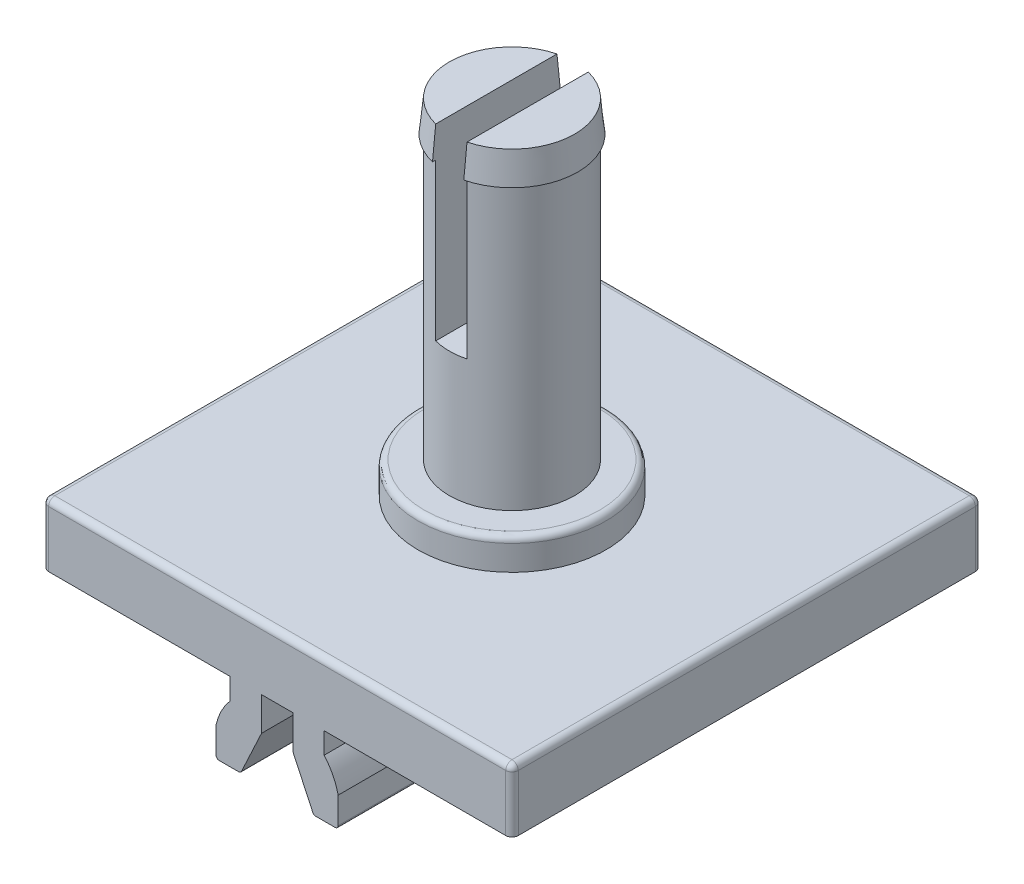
ISO-10303-21;
HEADER;
FILE_DESCRIPTION(('STEP AP214'),'2;1');
FILE_NAME('part.step','',(''),(''),'','','');
FILE_SCHEMA(('AUTOMOTIVE_DESIGN { 1 0 10303 214 1 1 1 1 }'));
ENDSEC;
DATA;
#1=APPLICATION_CONTEXT('core data for automotive mechanical design processes');
#2=APPLICATION_PROTOCOL_DEFINITION('international standard','automotive_design',2000,#1);
#3=PRODUCT_CONTEXT('',#1,'mechanical');
#4=PRODUCT('Part','Part','',(#3));
#5=PRODUCT_RELATED_PRODUCT_CATEGORY('part','',(#4));
#6=PRODUCT_DEFINITION_FORMATION('','',#4);
#7=PRODUCT_DEFINITION_CONTEXT('part definition',#1,'design');
#8=PRODUCT_DEFINITION('design','',#6,#7);
#9=PRODUCT_DEFINITION_SHAPE('','',#8);
#10=(LENGTH_UNIT() NAMED_UNIT(*) SI_UNIT(.MILLI.,.METRE.));
#11=(NAMED_UNIT(*) PLANE_ANGLE_UNIT() SI_UNIT($,.RADIAN.));
#12=(NAMED_UNIT(*) SI_UNIT($,.STERADIAN.) SOLID_ANGLE_UNIT());
#13=UNCERTAINTY_MEASURE_WITH_UNIT(LENGTH_MEASURE(1.E-05),#10,'distance_accuracy_value','');
#14=(GEOMETRIC_REPRESENTATION_CONTEXT(3) GLOBAL_UNCERTAINTY_ASSIGNED_CONTEXT((#13)) GLOBAL_UNIT_ASSIGNED_CONTEXT((#10,
#11,#12)) REPRESENTATION_CONTEXT('',''));
#15=CARTESIAN_POINT('',(0.,0.,0.));
#16=DIRECTION('',(0.,0.,1.));
#17=DIRECTION('',(1.,0.,0.));
#18=AXIS2_PLACEMENT_3D('',#15,#16,#17);
#19=CARTESIAN_POINT('',(0.,0.,0.));
#20=DIRECTION('',(0.,-1.,0.));
#21=DIRECTION('',(0.,0.,-1.));
#22=AXIS2_PLACEMENT_3D('',#19,#20,#21);
#23=PLANE('',#22);
#24=DIRECTION('',(-1.,0.,0.));
#25=VECTOR('',#24,1.);
#26=CARTESIAN_POINT('',(7.5,0.,-7.5));
#27=LINE('',#26,#25);
#28=CARTESIAN_POINT('',(7.3,0.,-7.5));
#29=VERTEX_POINT('',#28);
#30=CARTESIAN_POINT('',(1.5,0.,-7.5));
#31=VERTEX_POINT('',#30);
#32=EDGE_CURVE('E335',#29,#31,#27,.T.);
#33=ORIENTED_EDGE('',*,*,#32,.F.);
#34=CARTESIAN_POINT('',(7.3,0.,-7.3));
#35=DIRECTION('',(0.,-1.,0.));
#36=DIRECTION('',(0.,0.,-1.));
#37=AXIS2_PLACEMENT_3D('',#34,#35,#36);
#38=CIRCLE('',#37,0.2);
#39=CARTESIAN_POINT('',(7.5,0.,-7.3));
#40=VERTEX_POINT('',#39);
#41=EDGE_CURVE('E523',#29,#40,#38,.T.);
#42=ORIENTED_EDGE('',*,*,#41,.T.);
#43=DIRECTION('',(0.,0.,-1.));
#44=VECTOR('',#43,1.);
#45=CARTESIAN_POINT('',(7.5,0.,-7.5));
#46=LINE('',#45,#44);
#47=CARTESIAN_POINT('',(7.5,0.,7.3));
#48=VERTEX_POINT('',#47);
#49=EDGE_CURVE('E299',#48,#40,#46,.T.);
#50=ORIENTED_EDGE('',*,*,#49,.F.);
#51=CARTESIAN_POINT('',(7.3,0.,7.3));
#52=DIRECTION('',(0.,-1.,0.));
#53=DIRECTION('',(0.,0.,-1.));
#54=AXIS2_PLACEMENT_3D('',#51,#52,#53);
#55=CIRCLE('',#54,0.2);
#56=CARTESIAN_POINT('',(7.3,0.,7.5));
#57=VERTEX_POINT('',#56);
#58=EDGE_CURVE('E730',#48,#57,#55,.T.);
#59=ORIENTED_EDGE('',*,*,#58,.T.);
#60=DIRECTION('',(1.,0.,0.));
#61=VECTOR('',#60,1.);
#62=CARTESIAN_POINT('',(7.5,0.,7.5));
#63=LINE('',#62,#61);
#64=CARTESIAN_POINT('',(1.5,0.,7.5));
#65=VERTEX_POINT('',#64);
#66=EDGE_CURVE('E297',#65,#57,#63,.T.);
#67=ORIENTED_EDGE('',*,*,#66,.F.);
#68=DIRECTION('',(0.,0.,1.));
#69=VECTOR('',#68,1.);
#70=CARTESIAN_POINT('',(1.5,0.,-7.5));
#71=LINE('',#70,#69);
#72=EDGE_CURVE('E633',#31,#65,#71,.T.);
#73=ORIENTED_EDGE('',*,*,#72,.F.);
#74=EDGE_LOOP('',(#33,#42,#50,#59,#67,#73));
#75=FACE_BOUND('',#74,.T.);
#76=ADVANCED_FACE('F34',(#75),#23,.T.);
#77=DIRECTION('',(0.,0.,1.));
#78=VECTOR('',#77,1.);
#79=CARTESIAN_POINT('',(-7.5,0.,-7.49999999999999));
#80=LINE('',#79,#78);
#81=CARTESIAN_POINT('',(-7.5,0.,-7.29999999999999));
#82=VERTEX_POINT('',#81);
#83=CARTESIAN_POINT('',(-7.5,0.,7.30000000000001));
#84=VERTEX_POINT('',#83);
#85=EDGE_CURVE('E302',#82,#84,#80,.T.);
#86=ORIENTED_EDGE('',*,*,#85,.F.);
#87=CARTESIAN_POINT('',(-7.3,0.,-7.29999999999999));
#88=DIRECTION('',(0.,-1.,0.));
#89=DIRECTION('',(0.,0.,-1.));
#90=AXIS2_PLACEMENT_3D('',#87,#88,#89);
#91=CIRCLE('',#90,0.2);
#92=CARTESIAN_POINT('',(-7.3,0.,-7.49999999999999));
#93=VERTEX_POINT('',#92);
#94=EDGE_CURVE('E332',#82,#93,#91,.T.);
#95=ORIENTED_EDGE('',*,*,#94,.T.);
#96=CARTESIAN_POINT('',(-1.5,0.,-7.49999999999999));
#97=VERTEX_POINT('',#96);
#98=EDGE_CURVE('E307',#97,#93,#27,.T.);
#99=ORIENTED_EDGE('',*,*,#98,.F.);
#100=DIRECTION('',(0.,0.,1.));
#101=VECTOR('',#100,1.);
#102=CARTESIAN_POINT('',(-1.5,0.,-7.5));
#103=LINE('',#102,#101);
#104=CARTESIAN_POINT('',(-1.5,0.,7.50000000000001));
#105=VERTEX_POINT('',#104);
#106=EDGE_CURVE('E666',#97,#105,#103,.T.);
#107=ORIENTED_EDGE('',*,*,#106,.T.);
#108=CARTESIAN_POINT('',(-7.3,0.,7.50000000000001));
#109=VERTEX_POINT('',#108);
#110=EDGE_CURVE('E296',#109,#105,#63,.T.);
#111=ORIENTED_EDGE('',*,*,#110,.F.);
#112=CARTESIAN_POINT('',(-7.3,0.,7.30000000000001));
#113=DIRECTION('',(0.,-1.,0.));
#114=DIRECTION('',(0.,0.,-1.));
#115=AXIS2_PLACEMENT_3D('',#112,#113,#114);
#116=CIRCLE('',#115,0.2);
#117=EDGE_CURVE('E329',#109,#84,#116,.T.);
#118=ORIENTED_EDGE('',*,*,#117,.T.);
#119=EDGE_LOOP('',(#86,#95,#99,#107,#111,#118));
#120=FACE_BOUND('',#119,.T.);
#121=ADVANCED_FACE('F497',(#120),#23,.T.);
#122=CARTESIAN_POINT('',(-2.1,12.,0.));
#123=DIRECTION('',(0.,1.,0.));
#124=DIRECTION('',(0.,0.,1.));
#125=AXIS2_PLACEMENT_3D('',#122,#123,#124);
#126=PLANE('',#125);
#127=CARTESIAN_POINT('',(0.,12.,0.));
#128=DIRECTION('',(0.,-1.,0.));
#129=DIRECTION('',(0.,0.,-1.));
#130=AXIS2_PLACEMENT_3D('',#127,#128,#129);
#131=CIRCLE('',#130,2.1);
#132=CARTESIAN_POINT('',(0.499999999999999,12.,-2.03960780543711));
#133=VERTEX_POINT('',#132);
#134=CARTESIAN_POINT('',(0.5,12.,2.03960780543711));
#135=VERTEX_POINT('',#134);
#136=EDGE_CURVE('E439',#133,#135,#131,.T.);
#137=ORIENTED_EDGE('',*,*,#136,.T.);
#138=DIRECTION('',(0.,0.,-1.));
#139=VECTOR('',#138,1.);
#140=CARTESIAN_POINT('',(0.5,12.,0.));
#141=LINE('',#140,#139);
#142=CARTESIAN_POINT('',(0.5,12.,1.93649167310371));
#143=VERTEX_POINT('',#142);
#144=EDGE_CURVE('E427',#135,#143,#141,.T.);
#145=ORIENTED_EDGE('',*,*,#144,.T.);
#146=CARTESIAN_POINT('',(0.,12.,0.));
#147=DIRECTION('',(0.,1.,0.));
#148=DIRECTION('',(0.,0.,1.));
#149=AXIS2_PLACEMENT_3D('',#146,#147,#148);
#150=CIRCLE('',#149,2.);
#151=CARTESIAN_POINT('',(0.499999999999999,12.,-1.93649167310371));
#152=VERTEX_POINT('',#151);
#153=EDGE_CURVE('E346',#143,#152,#150,.T.);
#154=ORIENTED_EDGE('',*,*,#153,.T.);
#155=EDGE_CURVE('E429',#152,#133,#141,.T.);
#156=ORIENTED_EDGE('',*,*,#155,.T.);
#157=EDGE_LOOP('',(#137,#145,#154,#156));
#158=FACE_BOUND('',#157,.T.);
#159=ADVANCED_FACE('F769',(#158),#126,.F.);
#160=CARTESIAN_POINT('',(0.,13.,0.));
#161=DIRECTION('',(0.,-1.,0.));
#162=DIRECTION('',(0.,0.,-1.));
#163=AXIS2_PLACEMENT_3D('',#160,#161,#162);
#164=CONICAL_SURFACE('',#163,2.,0.0996686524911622);
#165=ORIENTED_EDGE('',*,*,#136,.F.);
#166=CARTESIAN_POINT('',(0.499999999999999,8.841130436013,-2.36357986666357));
#167=CARTESIAN_POINT('',(0.499999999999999,9.45810920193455,-2.30051294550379));
#168=CARTESIAN_POINT('',(0.499999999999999,10.075077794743,-2.23734624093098));
#169=CARTESIAN_POINT('',(0.499999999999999,11.3089863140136,-2.11073579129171));
#170=CARTESIAN_POINT('',(0.499999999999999,11.9259262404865,-2.04729204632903));
#171=CARTESIAN_POINT('',(0.499999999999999,13.1597696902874,-1.92004998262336));
#172=CARTESIAN_POINT('',(0.499999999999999,13.7766732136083,-1.85625166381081));
#173=CARTESIAN_POINT('',(0.499999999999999,15.0104289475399,-1.72815870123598));
#174=CARTESIAN_POINT('',(0.499999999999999,15.627281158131,-1.66386405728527));
#175=CARTESIAN_POINT('',(0.499999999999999,16.2441000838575,-1.59925039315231));
#176=B_SPLINE_CURVE_WITH_KNOTS('',3,(#166,#167,#168,#169,#170,#171,#172,#173,#174,#175),
.UNSPECIFIED.,.F.,.F.,(4,2,2,2,4),(0.,1.86058114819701,3.72116159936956,5.58174241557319,
7.44232393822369),.UNSPECIFIED.);
#177=CARTESIAN_POINT('',(0.499999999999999,13.,-1.93649167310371));
#178=VERTEX_POINT('',#177);
#179=EDGE_CURVE('E431',#133,#178,#176,.T.);
#180=ORIENTED_EDGE('',*,*,#179,.T.);
#181=CARTESIAN_POINT('',(0.,13.,0.));
#182=DIRECTION('',(0.,-1.,0.));
#183=DIRECTION('',(0.,0.,-1.));
#184=AXIS2_PLACEMENT_3D('',#181,#182,#183);
#185=CIRCLE('',#184,2.);
#186=CARTESIAN_POINT('',(0.5,13.,1.93649167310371));
#187=VERTEX_POINT('',#186);
#188=EDGE_CURVE('E443',#178,#187,#185,.T.);
#189=ORIENTED_EDGE('',*,*,#188,.T.);
#190=CARTESIAN_POINT('',(0.5,16.2441000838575,1.59925039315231));
#191=CARTESIAN_POINT('',(0.5,15.2336599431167,1.70508949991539));
#192=CARTESIAN_POINT('',(0.5,14.2231318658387,1.81008354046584));
#193=CARTESIAN_POINT('',(0.5,12.9893168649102,1.93760388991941));
#194=CARTESIAN_POINT('',(0.5,12.766083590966,1.96064915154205));
#195=CARTESIAN_POINT('',(0.5,11.9259262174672,2.0472929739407));
#196=CARTESIAN_POINT('',(0.5,11.3089861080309,2.11073627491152));
#197=CARTESIAN_POINT('',(0.5,10.0750774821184,2.23734581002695));
#198=CARTESIAN_POINT('',(0.500000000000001,9.45810896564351,2.3005120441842));
#199=CARTESIAN_POINT('',(0.5,8.841130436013,2.36357986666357));
#200=B_SPLINE_CURVE_WITH_KNOTS('',3,(#190,#191,#192,#193,#194,#195,#196,#197,#198,#199),
.UNSPECIFIED.,.F.,.F.,(4,2,2,2,4),(0.,3.04790325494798,3.72116219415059,5.58174303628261,
7.44232379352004),.UNSPECIFIED.);
#201=EDGE_CURVE('E421',#187,#135,#200,.T.);
#202=ORIENTED_EDGE('',*,*,#201,.T.);
#203=EDGE_LOOP('',(#165,#180,#189,#202));
#204=FACE_BOUND('',#203,.T.);
#205=ADVANCED_FACE('F1048',(#204),#164,.T.);
#206=CARTESIAN_POINT('',(0.,13.,0.));
#207=DIRECTION('',(0.,1.,0.));
#208=DIRECTION('',(0.,0.,1.));
#209=AXIS2_PLACEMENT_3D('',#206,#207,#208);
#210=PLANE('',#209);
#211=DIRECTION('',(0.,0.,-1.));
#212=VECTOR('',#211,1.);
#213=CARTESIAN_POINT('',(0.5,13.,0.));
#214=LINE('',#213,#212);
#215=EDGE_CURVE('E351',#187,#178,#214,.T.);
#216=ORIENTED_EDGE('',*,*,#215,.F.);
#217=ORIENTED_EDGE('',*,*,#188,.F.);
#218=EDGE_LOOP('',(#216,#217));
#219=FACE_BOUND('',#218,.T.);
#220=ADVANCED_FACE('F1055',(#219),#210,.T.);
#221=CARTESIAN_POINT('',(0.,13.,0.));
#222=DIRECTION('',(0.,-1.,0.));
#223=DIRECTION('',(0.,0.,-1.));
#224=AXIS2_PLACEMENT_3D('',#221,#222,#223);
#225=CYLINDRICAL_SURFACE('',#224,2.);
#226=ORIENTED_EDGE('',*,*,#153,.F.);
#227=DIRECTION('',(0.,-1.,0.));
#228=VECTOR('',#227,1.);
#229=CARTESIAN_POINT('',(0.5,13.,1.93649167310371));
#230=LINE('',#229,#228);
#231=CARTESIAN_POINT('',(0.5,7.,1.93649167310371));
#232=VERTEX_POINT('',#231);
#233=EDGE_CURVE('E366',#143,#232,#230,.T.);
#234=ORIENTED_EDGE('',*,*,#233,.T.);
#235=CARTESIAN_POINT('',(0.,7.,0.));
#236=DIRECTION('',(0.,-1.,0.));
#237=DIRECTION('',(0.,0.,-1.));
#238=AXIS2_PLACEMENT_3D('',#235,#236,#237);
#239=CIRCLE('',#238,2.);
#240=CARTESIAN_POINT('',(-0.499999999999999,7.,1.93649167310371));
#241=VERTEX_POINT('',#240);
#242=EDGE_CURVE('E325',#232,#241,#239,.T.);
#243=ORIENTED_EDGE('',*,*,#242,.T.);
#244=DIRECTION('',(0.,-1.,0.));
#245=VECTOR('',#244,1.);
#246=CARTESIAN_POINT('',(-0.499999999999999,13.,1.93649167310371));
#247=LINE('',#246,#245);
#248=CARTESIAN_POINT('',(-0.499999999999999,12.,1.93649167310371));
#249=VERTEX_POINT('',#248);
#250=EDGE_CURVE('E364',#241,#249,#247,.F.);
#251=ORIENTED_EDGE('',*,*,#250,.T.);
#252=CARTESIAN_POINT('',(-0.5,12.,-1.93649167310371));
#253=VERTEX_POINT('',#252);
#254=EDGE_CURVE('E345',#253,#249,#150,.T.);
#255=ORIENTED_EDGE('',*,*,#254,.F.);
#256=DIRECTION('',(0.,-1.,0.));
#257=VECTOR('',#256,1.);
#258=CARTESIAN_POINT('',(-0.5,13.,-1.93649167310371));
#259=LINE('',#258,#257);
#260=CARTESIAN_POINT('',(-0.5,7.,-1.93649167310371));
#261=VERTEX_POINT('',#260);
#262=EDGE_CURVE('E419',#253,#261,#259,.T.);
#263=ORIENTED_EDGE('',*,*,#262,.T.);
#264=CARTESIAN_POINT('',(0.499999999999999,7.,-1.93649167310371));
#265=VERTEX_POINT('',#264);
#266=EDGE_CURVE('E352',#261,#265,#239,.T.);
#267=ORIENTED_EDGE('',*,*,#266,.T.);
#268=DIRECTION('',(0.,-1.,0.));
#269=VECTOR('',#268,1.);
#270=CARTESIAN_POINT('',(0.499999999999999,13.,-1.93649167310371));
#271=LINE('',#270,#269);
#272=EDGE_CURVE('E378',#265,#152,#271,.F.);
#273=ORIENTED_EDGE('',*,*,#272,.T.);
#274=EDGE_LOOP('',(#226,#234,#243,#251,#255,#263,#267,#273));
#275=FACE_BOUND('',#274,.T.);
#276=CARTESIAN_POINT('',(0.,3.,0.));
#277=DIRECTION('',(0.,1.,0.));
#278=DIRECTION('',(0.,0.,1.));
#279=AXIS2_PLACEMENT_3D('',#276,#277,#278);
#280=CIRCLE('',#279,2.);
#281=CARTESIAN_POINT('',(0.,3.,2.));
#282=VERTEX_POINT('',#281);
#283=EDGE_CURVE('E445',#282,#282,#280,.T.);
#284=ORIENTED_EDGE('',*,*,#283,.T.);
#285=EDGE_LOOP('',(#284));
#286=FACE_BOUND('',#285,.T.);
#287=ADVANCED_FACE('F361',(#275,#286),#225,.T.);
#288=CARTESIAN_POINT('',(0.,3.,0.));
#289=DIRECTION('',(0.,1.,0.));
#290=DIRECTION('',(0.,0.,1.));
#291=AXIS2_PLACEMENT_3D('',#288,#289,#290);
#292=PLANE('',#291);
#293=CARTESIAN_POINT('',(0.,3.,0.));
#294=DIRECTION('',(0.,1.,0.));
#295=DIRECTION('',(0.,0.,1.));
#296=AXIS2_PLACEMENT_3D('',#293,#294,#295);
#297=CIRCLE('',#296,2.8);
#298=CARTESIAN_POINT('',(0.,3.,2.8));
#299=VERTEX_POINT('',#298);
#300=EDGE_CURVE('E545',#299,#299,#297,.T.);
#301=ORIENTED_EDGE('',*,*,#300,.T.);
#302=EDGE_LOOP('',(#301));
#303=FACE_BOUND('',#302,.T.);
#304=ORIENTED_EDGE('',*,*,#283,.F.);
#305=EDGE_LOOP('',(#304));
#306=FACE_BOUND('',#305,.T.);
#307=ADVANCED_FACE('F1095',(#303,#306),#292,.T.);
#308=CARTESIAN_POINT('',(0.,2.,0.));
#309=DIRECTION('',(0.,-1.,0.));
#310=DIRECTION('',(0.,0.,-1.));
#311=AXIS2_PLACEMENT_3D('',#308,#309,#310);
#312=PLANE('',#311);
#313=DIRECTION('',(1.,0.,0.));
#314=VECTOR('',#313,1.);
#315=CARTESIAN_POINT('',(0.,2.,7.30000000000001));
#316=LINE('',#315,#314);
#317=CARTESIAN_POINT('',(-7.3,2.,7.30000000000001));
#318=VERTEX_POINT('',#317);
#319=CARTESIAN_POINT('',(7.3,2.,7.3));
#320=VERTEX_POINT('',#319);
#321=EDGE_CURVE('E537',#318,#320,#316,.T.);
#322=ORIENTED_EDGE('',*,*,#321,.T.);
#323=DIRECTION('',(0.,0.,-1.));
#324=VECTOR('',#323,1.);
#325=CARTESIAN_POINT('',(7.3,2.,0.));
#326=LINE('',#325,#324);
#327=CARTESIAN_POINT('',(7.3,2.,-7.3));
#328=VERTEX_POINT('',#327);
#329=EDGE_CURVE('E542',#320,#328,#326,.T.);
#330=ORIENTED_EDGE('',*,*,#329,.T.);
#331=DIRECTION('',(-1.,0.,0.));
#332=VECTOR('',#331,1.);
#333=CARTESIAN_POINT('',(0.,2.,-7.3));
#334=LINE('',#333,#332);
#335=CARTESIAN_POINT('',(-7.3,2.,-7.29999999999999));
#336=VERTEX_POINT('',#335);
#337=EDGE_CURVE('E540',#328,#336,#334,.T.);
#338=ORIENTED_EDGE('',*,*,#337,.T.);
#339=DIRECTION('',(0.,0.,1.));
#340=VECTOR('',#339,1.);
#341=CARTESIAN_POINT('',(-7.3,2.,0.));
#342=LINE('',#341,#340);
#343=EDGE_CURVE('E483',#336,#318,#342,.T.);
#344=ORIENTED_EDGE('',*,*,#343,.T.);
#345=EDGE_LOOP('',(#322,#330,#338,#344));
#346=FACE_BOUND('',#345,.T.);
#347=CARTESIAN_POINT('',(0.,2.,0.));
#348=DIRECTION('',(0.,-1.,0.));
#349=DIRECTION('',(0.,0.,-1.));
#350=AXIS2_PLACEMENT_3D('',#347,#348,#349);
#351=CIRCLE('',#350,3.);
#352=CARTESIAN_POINT('',(0.,2.,-3.));
#353=VERTEX_POINT('',#352);
#354=EDGE_CURVE('E337',#353,#353,#351,.F.);
#355=ORIENTED_EDGE('',*,*,#354,.F.);
#356=EDGE_LOOP('',(#355));
#357=FACE_BOUND('',#356,.T.);
#358=ADVANCED_FACE('F719',(#346,#357),#312,.F.);
#359=CARTESIAN_POINT('',(-7.5,2.,-7.49999999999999));
#360=DIRECTION('',(1.,0.,0.));
#361=DIRECTION('',(0.,0.,-1.));
#362=AXIS2_PLACEMENT_3D('',#359,#360,#361);
#363=PLANE('',#362);
#364=DIRECTION('',(0.,0.,1.));
#365=VECTOR('',#364,1.);
#366=CARTESIAN_POINT('',(-7.5,1.8,-7.49999999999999));
#367=LINE('',#366,#365);
#368=CARTESIAN_POINT('',(-7.5,1.8,7.30000000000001));
#369=VERTEX_POINT('',#368);
#370=CARTESIAN_POINT('',(-7.5,1.8,-7.29999999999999));
#371=VERTEX_POINT('',#370);
#372=EDGE_CURVE('E322',#369,#371,#367,.F.);
#373=ORIENTED_EDGE('',*,*,#372,.T.);
#374=DIRECTION('',(0.,-1.,0.));
#375=VECTOR('',#374,1.);
#376=CARTESIAN_POINT('',(-7.5,2.,-7.29999999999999));
#377=LINE('',#376,#375);
#378=EDGE_CURVE('E327',#371,#82,#377,.T.);
#379=ORIENTED_EDGE('',*,*,#378,.T.);
#380=ORIENTED_EDGE('',*,*,#85,.T.);
#381=DIRECTION('',(0.,-1.,0.));
#382=VECTOR('',#381,1.);
#383=CARTESIAN_POINT('',(-7.5,2.,7.30000000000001));
#384=LINE('',#383,#382);
#385=EDGE_CURVE('E324',#84,#369,#384,.F.);
#386=ORIENTED_EDGE('',*,*,#385,.T.);
#387=EDGE_LOOP('',(#373,#379,#380,#386));
#388=FACE_BOUND('',#387,.T.);
#389=ADVANCED_FACE('F452',(#388),#363,.F.);
#390=CARTESIAN_POINT('',(7.5,2.,7.5));
#391=DIRECTION('',(0.,0.,-1.));
#392=DIRECTION('',(-1.,0.,0.));
#393=AXIS2_PLACEMENT_3D('',#390,#391,#392);
#394=PLANE('',#393);
#395=DIRECTION('',(0.,-1.,0.));
#396=VECTOR('',#395,1.);
#397=CARTESIAN_POINT('',(-1.95,-2.5,7.5));
#398=LINE('',#397,#396);
#399=CARTESIAN_POINT('',(-1.95,-1.55559027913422,7.5));
#400=VERTEX_POINT('',#399);
#401=CARTESIAN_POINT('',(-1.95,-2.4,7.5));
#402=VERTEX_POINT('',#401);
#403=EDGE_CURVE('E647',#400,#402,#398,.T.);
#404=ORIENTED_EDGE('',*,*,#403,.T.);
#405=CARTESIAN_POINT('',(-1.85,-2.4,7.50000000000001));
#406=DIRECTION('',(0.,0.,-1.));
#407=DIRECTION('',(-1.,0.,0.));
#408=AXIS2_PLACEMENT_3D('',#405,#406,#407);
#409=CIRCLE('',#408,0.1);
#410=CARTESIAN_POINT('',(-1.85,-2.5,7.5));
#411=VERTEX_POINT('',#410);
#412=EDGE_CURVE('E575',#402,#411,#409,.F.);
#413=ORIENTED_EDGE('',*,*,#412,.T.);
#414=DIRECTION('',(1.,0.,0.));
#415=VECTOR('',#414,1.);
#416=CARTESIAN_POINT('',(-1.16576914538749,-2.5,7.5));
#417=LINE('',#416,#415);
#418=CARTESIAN_POINT('',(-1.22947617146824,-2.5,7.5));
#419=VERTEX_POINT('',#418);
#420=EDGE_CURVE('E650',#411,#419,#417,.T.);
#421=ORIENTED_EDGE('',*,*,#420,.T.);
#422=CARTESIAN_POINT('',(-1.22947617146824,-2.4,7.50000000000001));
#423=DIRECTION('',(0.,0.,-1.));
#424=DIRECTION('',(-1.,0.,0.));
#425=AXIS2_PLACEMENT_3D('',#422,#423,#424);
#426=CIRCLE('',#425,0.1);
#427=CARTESIAN_POINT('',(-1.13884539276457,-2.44226182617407,7.5));
#428=VERTEX_POINT('',#427);
#429=EDGE_CURVE('E573',#419,#428,#426,.F.);
#430=ORIENTED_EDGE('',*,*,#429,.T.);
#431=DIRECTION('',(0.422618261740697,0.906307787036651,0.));
#432=VECTOR('',#431,1.);
#433=CARTESIAN_POINT('',(-0.5,-1.07225346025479,7.5));
#434=LINE('',#433,#432);
#435=CARTESIAN_POINT('',(-0.5,-1.07225346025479,7.5));
#436=VERTEX_POINT('',#435);
#437=EDGE_CURVE('E636',#428,#436,#434,.T.);
#438=ORIENTED_EDGE('',*,*,#437,.T.);
#439=DIRECTION('',(0.,1.,0.));
#440=VECTOR('',#439,1.);
#441=CARTESIAN_POINT('',(-0.5,0.,7.5));
#442=LINE('',#441,#440);
#443=CARTESIAN_POINT('',(-0.5,0.,7.5));
#444=VERTEX_POINT('',#443);
#445=EDGE_CURVE('E295',#436,#444,#442,.T.);
#446=ORIENTED_EDGE('',*,*,#445,.T.);
#447=CARTESIAN_POINT('',(0.5,0.,7.5));
#448=VERTEX_POINT('',#447);
#449=EDGE_CURVE('E286',#444,#448,#63,.T.);
#450=ORIENTED_EDGE('',*,*,#449,.T.);
#451=DIRECTION('',(0.,-1.,0.));
#452=VECTOR('',#451,1.);
#453=CARTESIAN_POINT('',(0.5,0.,7.5));
#454=LINE('',#453,#452);
#455=CARTESIAN_POINT('',(0.5,-1.07225346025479,7.5));
#456=VERTEX_POINT('',#455);
#457=EDGE_CURVE('E268',#448,#456,#454,.T.);
#458=ORIENTED_EDGE('',*,*,#457,.T.);
#459=DIRECTION('',(0.422618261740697,-0.906307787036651,0.));
#460=VECTOR('',#459,1.);
#461=CARTESIAN_POINT('',(0.5,-1.07225346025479,7.5));
#462=LINE('',#461,#460);
#463=CARTESIAN_POINT('',(1.13884539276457,-2.44226182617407,7.5));
#464=VERTEX_POINT('',#463);
#465=EDGE_CURVE('E279',#456,#464,#462,.T.);
#466=ORIENTED_EDGE('',*,*,#465,.T.);
#467=CARTESIAN_POINT('',(1.22947617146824,-2.4,7.50000000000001));
#468=DIRECTION('',(0.,0.,-1.));
#469=DIRECTION('',(-1.,0.,0.));
#470=AXIS2_PLACEMENT_3D('',#467,#468,#469);
#471=CIRCLE('',#470,0.1);
#472=CARTESIAN_POINT('',(1.22947617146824,-2.5,7.5));
#473=VERTEX_POINT('',#472);
#474=EDGE_CURVE('E571',#464,#473,#471,.F.);
#475=ORIENTED_EDGE('',*,*,#474,.T.);
#476=DIRECTION('',(1.,0.,0.));
#477=VECTOR('',#476,1.);
#478=CARTESIAN_POINT('',(1.16576914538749,-2.5,7.5));
#479=LINE('',#478,#477);
#480=CARTESIAN_POINT('',(1.85,-2.5,7.5));
#481=VERTEX_POINT('',#480);
#482=EDGE_CURVE('E603',#473,#481,#479,.T.);
#483=ORIENTED_EDGE('',*,*,#482,.T.);
#484=CARTESIAN_POINT('',(1.85,-2.4,7.50000000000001));
#485=DIRECTION('',(0.,0.,-1.));
#486=DIRECTION('',(-1.,0.,0.));
#487=AXIS2_PLACEMENT_3D('',#484,#485,#486);
#488=CIRCLE('',#487,0.1);
#489=CARTESIAN_POINT('',(1.95,-2.4,7.5));
#490=VERTEX_POINT('',#489);
#491=EDGE_CURVE('E569',#481,#490,#488,.F.);
#492=ORIENTED_EDGE('',*,*,#491,.T.);
#493=DIRECTION('',(0.,1.,0.));
#494=VECTOR('',#493,1.);
#495=CARTESIAN_POINT('',(1.95,-2.5,7.5));
#496=LINE('',#495,#494);
#497=CARTESIAN_POINT('',(1.95,-1.55559027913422,7.5));
#498=VERTEX_POINT('',#497);
#499=EDGE_CURVE('E615',#490,#498,#496,.T.);
#500=ORIENTED_EDGE('',*,*,#499,.T.);
#501=CARTESIAN_POINT('',(0.,-2.,7.5));
#502=DIRECTION('',(0.,0.,1.));
#503=DIRECTION('',(-1.,0.,0.));
#504=AXIS2_PLACEMENT_3D('',#501,#502,#503);
#505=CIRCLE('',#504,2.);
#506=CARTESIAN_POINT('',(1.5,-0.677124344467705,7.5));
#507=VERTEX_POINT('',#506);
#508=EDGE_CURVE('E619',#498,#507,#505,.T.);
#509=ORIENTED_EDGE('',*,*,#508,.T.);
#510=DIRECTION('',(0.,1.,0.));
#511=VECTOR('',#510,1.);
#512=CARTESIAN_POINT('',(1.5,0.,7.5));
#513=LINE('',#512,#511);
#514=EDGE_CURVE('E622',#507,#65,#513,.T.);
#515=ORIENTED_EDGE('',*,*,#514,.T.);
#516=ORIENTED_EDGE('',*,*,#66,.T.);
#517=DIRECTION('',(0.,-1.,0.));
#518=VECTOR('',#517,1.);
#519=CARTESIAN_POINT('',(7.3,2.,7.5));
#520=LINE('',#519,#518);
#521=CARTESIAN_POINT('',(7.3,1.8,7.5));
#522=VERTEX_POINT('',#521);
#523=EDGE_CURVE('E535',#57,#522,#520,.F.);
#524=ORIENTED_EDGE('',*,*,#523,.T.);
#525=DIRECTION('',(1.,0.,0.));
#526=VECTOR('',#525,1.);
#527=CARTESIAN_POINT('',(7.5,1.8,7.5));
#528=LINE('',#527,#526);
#529=CARTESIAN_POINT('',(-7.3,1.8,7.50000000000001));
#530=VERTEX_POINT('',#529);
#531=EDGE_CURVE('E527',#522,#530,#528,.F.);
#532=ORIENTED_EDGE('',*,*,#531,.T.);
#533=DIRECTION('',(0.,-1.,0.));
#534=VECTOR('',#533,1.);
#535=CARTESIAN_POINT('',(-7.3,2.,7.50000000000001));
#536=LINE('',#535,#534);
#537=EDGE_CURVE('E463',#530,#109,#536,.T.);
#538=ORIENTED_EDGE('',*,*,#537,.T.);
#539=ORIENTED_EDGE('',*,*,#110,.T.);
#540=DIRECTION('',(0.,-1.,0.));
#541=VECTOR('',#540,1.);
#542=CARTESIAN_POINT('',(-1.5,0.,7.5));
#543=LINE('',#542,#541);
#544=CARTESIAN_POINT('',(-1.5,-0.677124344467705,7.5));
#545=VERTEX_POINT('',#544);
#546=EDGE_CURVE('E648',#105,#545,#543,.T.);
#547=ORIENTED_EDGE('',*,*,#546,.T.);
#548=CARTESIAN_POINT('',(0.,-2.,7.5));
#549=DIRECTION('',(0.,0.,1.));
#550=DIRECTION('',(1.,0.,0.));
#551=AXIS2_PLACEMENT_3D('',#548,#549,#550);
#552=CIRCLE('',#551,2.);
#553=EDGE_CURVE('E644',#545,#400,#552,.T.);
#554=ORIENTED_EDGE('',*,*,#553,.T.);
#555=EDGE_LOOP('',(#404,#413,#421,#430,#438,#446,#450,#458,#466,#475,#483,#492,#500,#509,#515,
#516,#524,#532,#538,#539,#547,#554));
#556=FACE_BOUND('',#555,.T.);
#557=ADVANCED_FACE('F293',(#556),#394,.F.);
#558=CARTESIAN_POINT('',(7.5,2.,-7.5));
#559=DIRECTION('',(-1.,0.,0.));
#560=DIRECTION('',(0.,0.,1.));
#561=AXIS2_PLACEMENT_3D('',#558,#559,#560);
#562=PLANE('',#561);
#563=ORIENTED_EDGE('',*,*,#49,.T.);
#564=DIRECTION('',(0.,-1.,0.));
#565=VECTOR('',#564,1.);
#566=CARTESIAN_POINT('',(7.5,2.,-7.3));
#567=LINE('',#566,#565);
#568=CARTESIAN_POINT('',(7.5,1.8,-7.3));
#569=VERTEX_POINT('',#568);
#570=EDGE_CURVE('E512',#40,#569,#567,.F.);
#571=ORIENTED_EDGE('',*,*,#570,.T.);
#572=DIRECTION('',(0.,0.,-1.));
#573=VECTOR('',#572,1.);
#574=CARTESIAN_POINT('',(7.5,1.8,-7.5));
#575=LINE('',#574,#573);
#576=CARTESIAN_POINT('',(7.5,1.8,7.3));
#577=VERTEX_POINT('',#576);
#578=EDGE_CURVE('E530',#569,#577,#575,.F.);
#579=ORIENTED_EDGE('',*,*,#578,.T.);
#580=DIRECTION('',(0.,-1.,0.));
#581=VECTOR('',#580,1.);
#582=CARTESIAN_POINT('',(7.5,2.,7.3));
#583=LINE('',#582,#581);
#584=EDGE_CURVE('E515',#577,#48,#583,.T.);
#585=ORIENTED_EDGE('',*,*,#584,.T.);
#586=EDGE_LOOP('',(#563,#571,#579,#585));
#587=FACE_BOUND('',#586,.T.);
#588=ADVANCED_FACE('F511',(#587),#562,.F.);
#589=CARTESIAN_POINT('',(7.5,2.,-7.5));
#590=DIRECTION('',(0.,0.,1.));
#591=DIRECTION('',(1.,0.,0.));
#592=AXIS2_PLACEMENT_3D('',#589,#590,#591);
#593=PLANE('',#592);
#594=DIRECTION('',(1.,0.,0.));
#595=VECTOR('',#594,1.);
#596=CARTESIAN_POINT('',(-1.16576914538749,-2.5,-7.5));
#597=LINE('',#596,#595);
#598=CARTESIAN_POINT('',(-1.85,-2.5,-7.5));
#599=VERTEX_POINT('',#598);
#600=CARTESIAN_POINT('',(-1.22947617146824,-2.5,-7.5));
#601=VERTEX_POINT('',#600);
#602=EDGE_CURVE('E662',#599,#601,#597,.T.);
#603=ORIENTED_EDGE('',*,*,#602,.F.);
#604=CARTESIAN_POINT('',(-1.85,-2.4,-7.49999999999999));
#605=DIRECTION('',(0.,0.,1.));
#606=DIRECTION('',(1.,0.,0.));
#607=AXIS2_PLACEMENT_3D('',#604,#605,#606);
#608=CIRCLE('',#607,0.1);
#609=CARTESIAN_POINT('',(-1.95,-2.4,-7.5));
#610=VERTEX_POINT('',#609);
#611=EDGE_CURVE('E587',#599,#610,#608,.F.);
#612=ORIENTED_EDGE('',*,*,#611,.T.);
#613=DIRECTION('',(0.,-1.,0.));
#614=VECTOR('',#613,1.);
#615=CARTESIAN_POINT('',(-1.95,-2.5,-7.5));
#616=LINE('',#615,#614);
#617=CARTESIAN_POINT('',(-1.95,-1.55559027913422,-7.5));
#618=VERTEX_POINT('',#617);
#619=EDGE_CURVE('E659',#618,#610,#616,.T.);
#620=ORIENTED_EDGE('',*,*,#619,.F.);
#621=CARTESIAN_POINT('',(0.,-2.,-7.5));
#622=DIRECTION('',(0.,0.,1.));
#623=DIRECTION('',(1.,0.,0.));
#624=AXIS2_PLACEMENT_3D('',#621,#622,#623);
#625=CIRCLE('',#624,2.);
#626=CARTESIAN_POINT('',(-1.5,-0.677124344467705,-7.5));
#627=VERTEX_POINT('',#626);
#628=EDGE_CURVE('E656',#627,#618,#625,.T.);
#629=ORIENTED_EDGE('',*,*,#628,.F.);
#630=DIRECTION('',(0.,-1.,0.));
#631=VECTOR('',#630,1.);
#632=CARTESIAN_POINT('',(-1.5,0.,-7.5));
#633=LINE('',#632,#631);
#634=EDGE_CURVE('E506',#97,#627,#633,.T.);
#635=ORIENTED_EDGE('',*,*,#634,.F.);
#636=ORIENTED_EDGE('',*,*,#98,.T.);
#637=DIRECTION('',(0.,-1.,0.));
#638=VECTOR('',#637,1.);
#639=CARTESIAN_POINT('',(-7.3,2.,-7.49999999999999));
#640=LINE('',#639,#638);
#641=CARTESIAN_POINT('',(-7.3,1.8,-7.49999999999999));
#642=VERTEX_POINT('',#641);
#643=EDGE_CURVE('E495',#93,#642,#640,.F.);
#644=ORIENTED_EDGE('',*,*,#643,.T.);
#645=DIRECTION('',(-1.,0.,0.));
#646=VECTOR('',#645,1.);
#647=CARTESIAN_POINT('',(7.5,1.8,-7.5));
#648=LINE('',#647,#646);
#649=CARTESIAN_POINT('',(7.3,1.8,-7.5));
#650=VERTEX_POINT('',#649);
#651=EDGE_CURVE('E334',#642,#650,#648,.F.);
#652=ORIENTED_EDGE('',*,*,#651,.T.);
#653=DIRECTION('',(0.,-1.,0.));
#654=VECTOR('',#653,1.);
#655=CARTESIAN_POINT('',(7.3,2.,-7.5));
#656=LINE('',#655,#654);
#657=EDGE_CURVE('E734',#650,#29,#656,.T.);
#658=ORIENTED_EDGE('',*,*,#657,.T.);
#659=ORIENTED_EDGE('',*,*,#32,.T.);
#660=DIRECTION('',(0.,1.,0.));
#661=VECTOR('',#660,1.);
#662=CARTESIAN_POINT('',(1.5,0.,-7.5));
#663=LINE('',#662,#661);
#664=CARTESIAN_POINT('',(1.5,-0.677124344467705,-7.5));
#665=VERTEX_POINT('',#664);
#666=EDGE_CURVE('E289',#665,#31,#663,.T.);
#667=ORIENTED_EDGE('',*,*,#666,.F.);
#668=CARTESIAN_POINT('',(0.,-2.,-7.5));
#669=DIRECTION('',(0.,0.,1.));
#670=DIRECTION('',(-1.,0.,0.));
#671=AXIS2_PLACEMENT_3D('',#668,#669,#670);
#672=CIRCLE('',#671,2.);
#673=CARTESIAN_POINT('',(1.95,-1.55559027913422,-7.5));
#674=VERTEX_POINT('',#673);
#675=EDGE_CURVE('E628',#674,#665,#672,.T.);
#676=ORIENTED_EDGE('',*,*,#675,.F.);
#677=DIRECTION('',(0.,1.,0.));
#678=VECTOR('',#677,1.);
#679=CARTESIAN_POINT('',(1.95,-2.5,-7.5));
#680=LINE('',#679,#678);
#681=CARTESIAN_POINT('',(1.95,-2.4,-7.5));
#682=VERTEX_POINT('',#681);
#683=EDGE_CURVE('E607',#682,#674,#680,.T.);
#684=ORIENTED_EDGE('',*,*,#683,.F.);
#685=CARTESIAN_POINT('',(1.85,-2.4,-7.5));
#686=DIRECTION('',(0.,0.,1.));
#687=DIRECTION('',(1.,0.,0.));
#688=AXIS2_PLACEMENT_3D('',#685,#686,#687);
#689=CIRCLE('',#688,0.1);
#690=CARTESIAN_POINT('',(1.85,-2.5,-7.5));
#691=VERTEX_POINT('',#690);
#692=EDGE_CURVE('E582',#682,#691,#689,.F.);
#693=ORIENTED_EDGE('',*,*,#692,.T.);
#694=DIRECTION('',(1.,0.,0.));
#695=VECTOR('',#694,1.);
#696=CARTESIAN_POINT('',(1.16576914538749,-2.5,-7.5));
#697=LINE('',#696,#695);
#698=CARTESIAN_POINT('',(1.22947617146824,-2.5,-7.5));
#699=VERTEX_POINT('',#698);
#700=EDGE_CURVE('E600',#699,#691,#697,.T.);
#701=ORIENTED_EDGE('',*,*,#700,.F.);
#702=CARTESIAN_POINT('',(1.22947617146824,-2.4,-7.5));
#703=DIRECTION('',(0.,0.,1.));
#704=DIRECTION('',(1.,0.,0.));
#705=AXIS2_PLACEMENT_3D('',#702,#703,#704);
#706=CIRCLE('',#705,0.1);
#707=CARTESIAN_POINT('',(1.13884539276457,-2.44226182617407,-7.5));
#708=VERTEX_POINT('',#707);
#709=EDGE_CURVE('E57',#699,#708,#706,.F.);
#710=ORIENTED_EDGE('',*,*,#709,.T.);
#711=DIRECTION('',(0.422618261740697,-0.906307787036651,0.));
#712=VECTOR('',#711,1.);
#713=CARTESIAN_POINT('',(0.5,-1.07225346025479,-7.5));
#714=LINE('',#713,#712);
#715=CARTESIAN_POINT('',(0.5,-1.07225346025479,-7.5));
#716=VERTEX_POINT('',#715);
#717=EDGE_CURVE('E608',#716,#708,#714,.T.);
#718=ORIENTED_EDGE('',*,*,#717,.F.);
#719=DIRECTION('',(0.,-1.,0.));
#720=VECTOR('',#719,1.);
#721=CARTESIAN_POINT('',(0.5,0.,-7.5));
#722=LINE('',#721,#720);
#723=CARTESIAN_POINT('',(0.5,0.,-7.5));
#724=VERTEX_POINT('',#723);
#725=EDGE_CURVE('E624',#724,#716,#722,.T.);
#726=ORIENTED_EDGE('',*,*,#725,.F.);
#727=CARTESIAN_POINT('',(-0.5,0.,-7.5));
#728=VERTEX_POINT('',#727);
#729=EDGE_CURVE('E288',#724,#728,#27,.T.);
#730=ORIENTED_EDGE('',*,*,#729,.T.);
#731=DIRECTION('',(0.,1.,0.));
#732=VECTOR('',#731,1.);
#733=CARTESIAN_POINT('',(-0.5,0.,-7.5));
#734=LINE('',#733,#732);
#735=CARTESIAN_POINT('',(-0.5,-1.07225346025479,-7.5));
#736=VERTEX_POINT('',#735);
#737=EDGE_CURVE('E655',#736,#728,#734,.T.);
#738=ORIENTED_EDGE('',*,*,#737,.F.);
#739=DIRECTION('',(0.422618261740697,0.906307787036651,0.));
#740=VECTOR('',#739,1.);
#741=CARTESIAN_POINT('',(-0.5,-1.07225346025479,-7.5));
#742=LINE('',#741,#740);
#743=CARTESIAN_POINT('',(-1.13884539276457,-2.44226182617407,-7.5));
#744=VERTEX_POINT('',#743);
#745=EDGE_CURVE('E653',#744,#736,#742,.T.);
#746=ORIENTED_EDGE('',*,*,#745,.F.);
#747=CARTESIAN_POINT('',(-1.22947617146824,-2.4,-7.5));
#748=DIRECTION('',(0.,0.,1.));
#749=DIRECTION('',(1.,0.,0.));
#750=AXIS2_PLACEMENT_3D('',#747,#748,#749);
#751=CIRCLE('',#750,0.1);
#752=EDGE_CURVE('E585',#744,#601,#751,.F.);
#753=ORIENTED_EDGE('',*,*,#752,.T.);
#754=EDGE_LOOP('',(#603,#612,#620,#629,#635,#636,#644,#652,#658,#659,#667,#676,#684,#693,#701,
#710,#718,#726,#730,#738,#746,#753));
#755=FACE_BOUND('',#754,.T.);
#756=ADVANCED_FACE('F502',(#755),#593,.F.);
#757=DIRECTION('',(0.,0.,1.));
#758=VECTOR('',#757,1.);
#759=CARTESIAN_POINT('',(0.5,0.,-7.5));
#760=LINE('',#759,#758);
#761=EDGE_CURVE('E272',#724,#448,#760,.T.);
#762=ORIENTED_EDGE('',*,*,#761,.T.);
#763=ORIENTED_EDGE('',*,*,#449,.F.);
#764=DIRECTION('',(0.,0.,1.));
#765=VECTOR('',#764,1.);
#766=CARTESIAN_POINT('',(-0.5,0.,-7.5));
#767=LINE('',#766,#765);
#768=EDGE_CURVE('E310',#728,#444,#767,.T.);
#769=ORIENTED_EDGE('',*,*,#768,.F.);
#770=ORIENTED_EDGE('',*,*,#729,.F.);
#771=EDGE_LOOP('',(#762,#763,#769,#770));
#772=FACE_BOUND('',#771,.T.);
#773=ADVANCED_FACE('F284',(#772),#23,.T.);
#774=CARTESIAN_POINT('',(0.,3.,0.));
#775=DIRECTION('',(0.,-1.,0.));
#776=DIRECTION('',(0.,0.,-1.));
#777=AXIS2_PLACEMENT_3D('',#774,#775,#776);
#778=CYLINDRICAL_SURFACE('',#777,3.);
#779=CARTESIAN_POINT('',(0.,2.8,0.));
#780=DIRECTION('',(0.,1.,0.));
#781=DIRECTION('',(0.,0.,1.));
#782=AXIS2_PLACEMENT_3D('',#779,#780,#781);
#783=CIRCLE('',#782,3.);
#784=CARTESIAN_POINT('',(0.,2.8,3.));
#785=VERTEX_POINT('',#784);
#786=EDGE_CURVE('E548',#785,#785,#783,.F.);
#787=ORIENTED_EDGE('',*,*,#786,.T.);
#788=EDGE_LOOP('',(#787));
#789=FACE_BOUND('',#788,.T.);
#790=ORIENTED_EDGE('',*,*,#354,.T.);
#791=EDGE_LOOP('',(#790));
#792=FACE_BOUND('',#791,.T.);
#793=ADVANCED_FACE('F773',(#789,#792),#778,.T.);
#794=CARTESIAN_POINT('',(-0.499999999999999,12.,2.03960780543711));
#795=VERTEX_POINT('',#794);
#796=CARTESIAN_POINT('',(-0.5,12.,-2.03960780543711));
#797=VERTEX_POINT('',#796);
#798=EDGE_CURVE('E438',#795,#797,#131,.T.);
#799=ORIENTED_EDGE('',*,*,#798,.T.);
#800=DIRECTION('',(0.,0.,1.));
#801=VECTOR('',#800,1.);
#802=CARTESIAN_POINT('',(-0.5,12.,0.));
#803=LINE('',#802,#801);
#804=EDGE_CURVE('E418',#797,#253,#803,.T.);
#805=ORIENTED_EDGE('',*,*,#804,.T.);
#806=ORIENTED_EDGE('',*,*,#254,.T.);
#807=EDGE_CURVE('E395',#249,#795,#803,.T.);
#808=ORIENTED_EDGE('',*,*,#807,.T.);
#809=EDGE_LOOP('',(#799,#805,#806,#808));
#810=FACE_BOUND('',#809,.T.);
#811=ADVANCED_FACE('F778',(#810),#126,.F.);
#812=CARTESIAN_POINT('',(-0.499999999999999,13.,1.93649167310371));
#813=VERTEX_POINT('',#812);
#814=CARTESIAN_POINT('',(-0.5,13.,-1.93649167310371));
#815=VERTEX_POINT('',#814);
#816=EDGE_CURVE('E442',#813,#815,#185,.T.);
#817=ORIENTED_EDGE('',*,*,#816,.T.);
#818=CARTESIAN_POINT('',(-0.5,16.2441000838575,-1.59925039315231));
#819=CARTESIAN_POINT('',(-0.5,15.2336599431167,-1.70508949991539));
#820=CARTESIAN_POINT('',(-0.5,14.2231318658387,-1.81008354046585));
#821=CARTESIAN_POINT('',(-0.5,12.9893168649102,-1.93760388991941));
#822=CARTESIAN_POINT('',(-0.5,12.766083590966,-1.96064915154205));
#823=CARTESIAN_POINT('',(-0.5,11.9259262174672,-2.0472929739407));
#824=CARTESIAN_POINT('',(-0.5,11.3089861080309,-2.11073627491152));
#825=CARTESIAN_POINT('',(-0.5,10.0750774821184,-2.23734581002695));
#826=CARTESIAN_POINT('',(-0.5,9.45810896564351,-2.3005120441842));
#827=CARTESIAN_POINT('',(-0.5,8.841130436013,-2.36357986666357));
#828=B_SPLINE_CURVE_WITH_KNOTS('',3,(#818,#819,#820,#821,#822,#823,#824,#825,#826,#827),
.UNSPECIFIED.,.F.,.F.,(4,2,2,2,4),(0.,3.04790325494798,3.72116219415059,5.58174303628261,
7.44232379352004),.UNSPECIFIED.);
#829=EDGE_CURVE('E412',#815,#797,#828,.T.);
#830=ORIENTED_EDGE('',*,*,#829,.T.);
#831=ORIENTED_EDGE('',*,*,#798,.F.);
#832=CARTESIAN_POINT('',(-0.499999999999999,8.841130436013,2.36357986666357));
#833=CARTESIAN_POINT('',(-0.499999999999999,9.45810920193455,2.30051294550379));
#834=CARTESIAN_POINT('',(-0.499999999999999,10.075077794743,2.23734624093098));
#835=CARTESIAN_POINT('',(-0.499999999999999,11.3089863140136,2.11073579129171));
#836=CARTESIAN_POINT('',(-0.499999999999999,11.9259262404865,2.04729204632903));
#837=CARTESIAN_POINT('',(-0.499999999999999,13.1597696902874,1.92004998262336));
#838=CARTESIAN_POINT('',(-0.499999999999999,13.7766732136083,1.85625166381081));
#839=CARTESIAN_POINT('',(-0.499999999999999,15.0104289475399,1.72815870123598));
#840=CARTESIAN_POINT('',(-0.499999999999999,15.627281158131,1.66386405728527));
#841=CARTESIAN_POINT('',(-0.499999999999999,16.2441000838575,1.59925039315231));
#842=B_SPLINE_CURVE_WITH_KNOTS('',3,(#832,#833,#834,#835,#836,#837,#838,#839,#840,#841),
.UNSPECIFIED.,.F.,.F.,(4,2,2,2,4),(0.,1.86058114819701,3.72116159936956,5.58174241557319,
7.44232393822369),.UNSPECIFIED.);
#843=EDGE_CURVE('E381',#795,#813,#842,.T.);
#844=ORIENTED_EDGE('',*,*,#843,.T.);
#845=EDGE_LOOP('',(#817,#830,#831,#844));
#846=FACE_BOUND('',#845,.T.);
#847=ADVANCED_FACE('F397',(#846),#164,.T.);
#848=DIRECTION('',(0.,0.,1.));
#849=VECTOR('',#848,1.);
#850=CARTESIAN_POINT('',(-0.5,13.,0.));
#851=LINE('',#850,#849);
#852=EDGE_CURVE('E349',#815,#813,#851,.T.);
#853=ORIENTED_EDGE('',*,*,#852,.F.);
#854=ORIENTED_EDGE('',*,*,#816,.F.);
#855=EDGE_LOOP('',(#853,#854));
#856=FACE_BOUND('',#855,.T.);
#857=ADVANCED_FACE('F1046',(#856),#210,.T.);
#858=CARTESIAN_POINT('',(0.,7.,0.));
#859=DIRECTION('',(0.,-1.,0.));
#860=DIRECTION('',(0.,0.,-1.));
#861=AXIS2_PLACEMENT_3D('',#858,#859,#860);
#862=PLANE('',#861);
#863=DIRECTION('',(0.,0.,-1.));
#864=VECTOR('',#863,1.);
#865=CARTESIAN_POINT('',(0.499999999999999,7.,-3.));
#866=LINE('',#865,#864);
#867=EDGE_CURVE('E372',#232,#265,#866,.T.);
#868=ORIENTED_EDGE('',*,*,#867,.T.);
#869=ORIENTED_EDGE('',*,*,#266,.F.);
#870=DIRECTION('',(0.,0.,1.));
#871=VECTOR('',#870,1.);
#872=CARTESIAN_POINT('',(-0.5,7.,-3.));
#873=LINE('',#872,#871);
#874=EDGE_CURVE('E374',#261,#241,#873,.T.);
#875=ORIENTED_EDGE('',*,*,#874,.T.);
#876=ORIENTED_EDGE('',*,*,#242,.F.);
#877=EDGE_LOOP('',(#868,#869,#875,#876));
#878=FACE_BOUND('',#877,.T.);
#879=ADVANCED_FACE('F371',(#878),#862,.F.);
#880=CARTESIAN_POINT('',(0.499999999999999,7.,-3.));
#881=DIRECTION('',(1.,0.,0.));
#882=DIRECTION('',(0.,0.,-1.));
#883=AXIS2_PLACEMENT_3D('',#880,#881,#882);
#884=PLANE('',#883);
#885=ORIENTED_EDGE('',*,*,#867,.F.);
#886=ORIENTED_EDGE('',*,*,#233,.F.);
#887=ORIENTED_EDGE('',*,*,#144,.F.);
#888=ORIENTED_EDGE('',*,*,#201,.F.);
#889=ORIENTED_EDGE('',*,*,#215,.T.);
#890=ORIENTED_EDGE('',*,*,#179,.F.);
#891=ORIENTED_EDGE('',*,*,#155,.F.);
#892=ORIENTED_EDGE('',*,*,#272,.F.);
#893=EDGE_LOOP('',(#885,#886,#887,#888,#889,#890,#891,#892));
#894=FACE_BOUND('',#893,.T.);
#895=ADVANCED_FACE('F376',(#894),#884,.F.);
#896=CARTESIAN_POINT('',(-0.5,7.,-3.));
#897=DIRECTION('',(-1.,0.,0.));
#898=DIRECTION('',(0.,0.,1.));
#899=AXIS2_PLACEMENT_3D('',#896,#897,#898);
#900=PLANE('',#899);
#901=ORIENTED_EDGE('',*,*,#804,.F.);
#902=ORIENTED_EDGE('',*,*,#829,.F.);
#903=ORIENTED_EDGE('',*,*,#852,.T.);
#904=ORIENTED_EDGE('',*,*,#843,.F.);
#905=ORIENTED_EDGE('',*,*,#807,.F.);
#906=ORIENTED_EDGE('',*,*,#250,.F.);
#907=ORIENTED_EDGE('',*,*,#874,.F.);
#908=ORIENTED_EDGE('',*,*,#262,.F.);
#909=EDGE_LOOP('',(#901,#902,#903,#904,#905,#906,#907,#908));
#910=FACE_BOUND('',#909,.T.);
#911=ADVANCED_FACE('F401',(#910),#900,.F.);
#912=CARTESIAN_POINT('',(-0.5,-1.07225346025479,-7.5));
#913=DIRECTION('',(0.906307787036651,-0.422618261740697,0.));
#914=DIRECTION('',(0.422618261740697,0.906307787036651,0.));
#915=AXIS2_PLACEMENT_3D('',#912,#913,#914);
#916=PLANE('',#915);
#917=ORIENTED_EDGE('',*,*,#437,.F.);
#918=DIRECTION('',(0.,0.,1.));
#919=VECTOR('',#918,1.);
#920=CARTESIAN_POINT('',(-1.13884539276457,-2.44226182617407,-7.5));
#921=LINE('',#920,#919);
#922=EDGE_CURVE('E49',#428,#744,#921,.F.);
#923=ORIENTED_EDGE('',*,*,#922,.T.);
#924=ORIENTED_EDGE('',*,*,#745,.T.);
#925=DIRECTION('',(0.,0.,1.));
#926=VECTOR('',#925,1.);
#927=CARTESIAN_POINT('',(-0.5,-1.07225346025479,-7.5));
#928=LINE('',#927,#926);
#929=EDGE_CURVE('E386',#736,#436,#928,.T.);
#930=ORIENTED_EDGE('',*,*,#929,.T.);
#931=EDGE_LOOP('',(#917,#923,#924,#930));
#932=FACE_BOUND('',#931,.T.);
#933=ADVANCED_FACE('F406',(#932),#916,.T.);
#934=CARTESIAN_POINT('',(-1.16576914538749,-2.5,-7.5));
#935=DIRECTION('',(0.,-1.,0.));
#936=DIRECTION('',(1.,0.,0.));
#937=AXIS2_PLACEMENT_3D('',#934,#935,#936);
#938=PLANE('',#937);
#939=ORIENTED_EDGE('',*,*,#420,.F.);
#940=DIRECTION('',(0.,0.,1.));
#941=VECTOR('',#940,1.);
#942=CARTESIAN_POINT('',(-1.85,-2.5,-7.5));
#943=LINE('',#942,#941);
#944=EDGE_CURVE('E580',#411,#599,#943,.F.);
#945=ORIENTED_EDGE('',*,*,#944,.T.);
#946=ORIENTED_EDGE('',*,*,#602,.T.);
#947=DIRECTION('',(0.,0.,1.));
#948=VECTOR('',#947,1.);
#949=CARTESIAN_POINT('',(-1.22947617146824,-2.5,-7.5));
#950=LINE('',#949,#948);
#951=EDGE_CURVE('E577',#601,#419,#950,.T.);
#952=ORIENTED_EDGE('',*,*,#951,.T.);
#953=EDGE_LOOP('',(#939,#945,#946,#952));
#954=FACE_BOUND('',#953,.T.);
#955=ADVANCED_FACE('F696',(#954),#938,.T.);
#956=CARTESIAN_POINT('',(-1.95,-2.5,-7.5));
#957=DIRECTION('',(-1.,0.,0.));
#958=DIRECTION('',(0.,0.,1.));
#959=AXIS2_PLACEMENT_3D('',#956,#957,#958);
#960=PLANE('',#959);
#961=ORIENTED_EDGE('',*,*,#619,.T.);
#962=DIRECTION('',(0.,0.,1.));
#963=VECTOR('',#962,1.);
#964=CARTESIAN_POINT('',(-1.95,-2.4,-7.5));
#965=LINE('',#964,#963);
#966=EDGE_CURVE('E550',#610,#402,#965,.T.);
#967=ORIENTED_EDGE('',*,*,#966,.T.);
#968=ORIENTED_EDGE('',*,*,#403,.F.);
#969=DIRECTION('',(0.,0.,1.));
#970=VECTOR('',#969,1.);
#971=CARTESIAN_POINT('',(-1.95,-1.55559027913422,-7.5));
#972=LINE('',#971,#970);
#973=EDGE_CURVE('E379',#618,#400,#972,.T.);
#974=ORIENTED_EDGE('',*,*,#973,.F.);
#975=EDGE_LOOP('',(#961,#967,#968,#974));
#976=FACE_BOUND('',#975,.T.);
#977=ADVANCED_FACE('F703',(#976),#960,.T.);
#978=CARTESIAN_POINT('',(0.,-2.,-7.5));
#979=DIRECTION('',(0.,0.,1.));
#980=DIRECTION('',(1.,0.,0.));
#981=AXIS2_PLACEMENT_3D('',#978,#979,#980);
#982=CYLINDRICAL_SURFACE('',#981,2.);
#983=ORIENTED_EDGE('',*,*,#973,.T.);
#984=ORIENTED_EDGE('',*,*,#553,.F.);
#985=DIRECTION('',(0.,0.,1.));
#986=VECTOR('',#985,1.);
#987=CARTESIAN_POINT('',(-1.5,-0.677124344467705,-7.5));
#988=LINE('',#987,#986);
#989=EDGE_CURVE('E383',#627,#545,#988,.T.);
#990=ORIENTED_EDGE('',*,*,#989,.F.);
#991=ORIENTED_EDGE('',*,*,#628,.T.);
#992=EDGE_LOOP('',(#983,#984,#990,#991));
#993=FACE_BOUND('',#992,.T.);
#994=ADVANCED_FACE('F706',(#993),#982,.T.);
#995=CARTESIAN_POINT('',(-1.5,0.,-7.5));
#996=DIRECTION('',(-1.,0.,0.));
#997=DIRECTION('',(0.,-1.,0.));
#998=AXIS2_PLACEMENT_3D('',#995,#996,#997);
#999=PLANE('',#998);
#1000=ORIENTED_EDGE('',*,*,#989,.T.);
#1001=ORIENTED_EDGE('',*,*,#546,.F.);
#1002=ORIENTED_EDGE('',*,*,#106,.F.);
#1003=ORIENTED_EDGE('',*,*,#634,.T.);
#1004=EDGE_LOOP('',(#1000,#1001,#1002,#1003));
#1005=FACE_BOUND('',#1004,.T.);
#1006=ADVANCED_FACE('F708',(#1005),#999,.T.);
#1007=CARTESIAN_POINT('',(-0.5,0.,-7.5));
#1008=DIRECTION('',(1.,0.,0.));
#1009=DIRECTION('',(0.,0.,-1.));
#1010=AXIS2_PLACEMENT_3D('',#1007,#1008,#1009);
#1011=PLANE('',#1010);
#1012=ORIENTED_EDGE('',*,*,#768,.T.);
#1013=ORIENTED_EDGE('',*,*,#445,.F.);
#1014=ORIENTED_EDGE('',*,*,#929,.F.);
#1015=ORIENTED_EDGE('',*,*,#737,.T.);
#1016=EDGE_LOOP('',(#1012,#1013,#1014,#1015));
#1017=FACE_BOUND('',#1016,.T.);
#1018=ADVANCED_FACE('F687',(#1017),#1011,.T.);
#1019=CARTESIAN_POINT('',(1.5,0.,-7.5));
#1020=DIRECTION('',(1.,0.,0.));
#1021=DIRECTION('',(0.,1.,0.));
#1022=AXIS2_PLACEMENT_3D('',#1019,#1020,#1021);
#1023=PLANE('',#1022);
#1024=ORIENTED_EDGE('',*,*,#72,.T.);
#1025=ORIENTED_EDGE('',*,*,#514,.F.);
#1026=DIRECTION('',(0.,0.,1.));
#1027=VECTOR('',#1026,1.);
#1028=CARTESIAN_POINT('',(1.5,-0.677124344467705,-7.5));
#1029=LINE('',#1028,#1027);
#1030=EDGE_CURVE('E637',#665,#507,#1029,.T.);
#1031=ORIENTED_EDGE('',*,*,#1030,.F.);
#1032=ORIENTED_EDGE('',*,*,#666,.T.);
#1033=EDGE_LOOP('',(#1024,#1025,#1031,#1032));
#1034=FACE_BOUND('',#1033,.T.);
#1035=ADVANCED_FACE('F741',(#1034),#1023,.T.);
#1036=CARTESIAN_POINT('',(0.,-2.,-7.5));
#1037=DIRECTION('',(0.,0.,1.));
#1038=DIRECTION('',(1.,0.,0.));
#1039=AXIS2_PLACEMENT_3D('',#1036,#1037,#1038);
#1040=CYLINDRICAL_SURFACE('',#1039,2.);
#1041=ORIENTED_EDGE('',*,*,#1030,.T.);
#1042=ORIENTED_EDGE('',*,*,#508,.F.);
#1043=DIRECTION('',(0.,0.,1.));
#1044=VECTOR('',#1043,1.);
#1045=CARTESIAN_POINT('',(1.95,-1.55559027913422,-7.5));
#1046=LINE('',#1045,#1044);
#1047=EDGE_CURVE('E639',#674,#498,#1046,.T.);
#1048=ORIENTED_EDGE('',*,*,#1047,.F.);
#1049=ORIENTED_EDGE('',*,*,#675,.T.);
#1050=EDGE_LOOP('',(#1041,#1042,#1048,#1049));
#1051=FACE_BOUND('',#1050,.T.);
#1052=ADVANCED_FACE('F745',(#1051),#1040,.T.);
#1053=CARTESIAN_POINT('',(1.95,-2.5,-7.5));
#1054=DIRECTION('',(1.,0.,0.));
#1055=DIRECTION('',(0.,1.,0.));
#1056=AXIS2_PLACEMENT_3D('',#1053,#1054,#1055);
#1057=PLANE('',#1056);
#1058=ORIENTED_EDGE('',*,*,#499,.F.);
#1059=DIRECTION('',(0.,0.,1.));
#1060=VECTOR('',#1059,1.);
#1061=CARTESIAN_POINT('',(1.95,-2.4,-7.5));
#1062=LINE('',#1061,#1060);
#1063=EDGE_CURVE('E11',#490,#682,#1062,.F.);
#1064=ORIENTED_EDGE('',*,*,#1063,.T.);
#1065=ORIENTED_EDGE('',*,*,#683,.T.);
#1066=ORIENTED_EDGE('',*,*,#1047,.T.);
#1067=EDGE_LOOP('',(#1058,#1064,#1065,#1066));
#1068=FACE_BOUND('',#1067,.T.);
#1069=ADVANCED_FACE('F749',(#1068),#1057,.T.);
#1070=CARTESIAN_POINT('',(1.16576914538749,-2.5,-7.5));
#1071=DIRECTION('',(0.,-1.,0.));
#1072=DIRECTION('',(1.,0.,0.));
#1073=AXIS2_PLACEMENT_3D('',#1070,#1071,#1072);
#1074=PLANE('',#1073);
#1075=ORIENTED_EDGE('',*,*,#482,.F.);
#1076=DIRECTION('',(0.,0.,1.));
#1077=VECTOR('',#1076,1.);
#1078=CARTESIAN_POINT('',(1.22947617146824,-2.5,-7.5));
#1079=LINE('',#1078,#1077);
#1080=EDGE_CURVE('E42',#473,#699,#1079,.F.);
#1081=ORIENTED_EDGE('',*,*,#1080,.T.);
#1082=ORIENTED_EDGE('',*,*,#700,.T.);
#1083=DIRECTION('',(0.,0.,1.));
#1084=VECTOR('',#1083,1.);
#1085=CARTESIAN_POINT('',(1.85,-2.5,-7.5));
#1086=LINE('',#1085,#1084);
#1087=EDGE_CURVE('E593',#691,#481,#1086,.T.);
#1088=ORIENTED_EDGE('',*,*,#1087,.T.);
#1089=EDGE_LOOP('',(#1075,#1081,#1082,#1088));
#1090=FACE_BOUND('',#1089,.T.);
#1091=ADVANCED_FACE('F599',(#1090),#1074,.T.);
#1092=CARTESIAN_POINT('',(0.5,-1.07225346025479,-7.5));
#1093=DIRECTION('',(-0.906307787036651,-0.422618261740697,0.));
#1094=DIRECTION('',(0.422618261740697,-0.906307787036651,0.));
#1095=AXIS2_PLACEMENT_3D('',#1092,#1093,#1094);
#1096=PLANE('',#1095);
#1097=ORIENTED_EDGE('',*,*,#717,.T.);
#1098=DIRECTION('',(0.,0.,1.));
#1099=VECTOR('',#1098,1.);
#1100=CARTESIAN_POINT('',(1.13884539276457,-2.44226182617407,-7.5));
#1101=LINE('',#1100,#1099);
#1102=EDGE_CURVE('E590',#708,#464,#1101,.T.);
#1103=ORIENTED_EDGE('',*,*,#1102,.T.);
#1104=ORIENTED_EDGE('',*,*,#465,.F.);
#1105=DIRECTION('',(0.,0.,1.));
#1106=VECTOR('',#1105,1.);
#1107=CARTESIAN_POINT('',(0.5,-1.07225346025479,-7.5));
#1108=LINE('',#1107,#1106);
#1109=EDGE_CURVE('E274',#716,#456,#1108,.T.);
#1110=ORIENTED_EDGE('',*,*,#1109,.F.);
#1111=EDGE_LOOP('',(#1097,#1103,#1104,#1110));
#1112=FACE_BOUND('',#1111,.T.);
#1113=ADVANCED_FACE('F613',(#1112),#1096,.T.);
#1114=CARTESIAN_POINT('',(0.5,0.,-7.5));
#1115=DIRECTION('',(-1.,0.,0.));
#1116=DIRECTION('',(0.,-1.,0.));
#1117=AXIS2_PLACEMENT_3D('',#1114,#1115,#1116);
#1118=PLANE('',#1117);
#1119=ORIENTED_EDGE('',*,*,#1109,.T.);
#1120=ORIENTED_EDGE('',*,*,#457,.F.);
#1121=ORIENTED_EDGE('',*,*,#761,.F.);
#1122=ORIENTED_EDGE('',*,*,#725,.T.);
#1123=EDGE_LOOP('',(#1119,#1120,#1121,#1122));
#1124=FACE_BOUND('',#1123,.T.);
#1125=ADVANCED_FACE('F270',(#1124),#1118,.T.);
#1126=CARTESIAN_POINT('',(7.3,2.,7.3));
#1127=DIRECTION('',(0.,-1.,0.));
#1128=DIRECTION('',(0.,0.,-1.));
#1129=AXIS2_PLACEMENT_3D('',#1126,#1127,#1128);
#1130=CYLINDRICAL_SURFACE('',#1129,0.2);
#1131=CARTESIAN_POINT('',(7.3,1.8,7.3));
#1132=DIRECTION('',(0.,1.,0.));
#1133=DIRECTION('',(0.,0.,1.));
#1134=AXIS2_PLACEMENT_3D('',#1131,#1132,#1133);
#1135=CIRCLE('',#1134,0.2);
#1136=EDGE_CURVE('E280',#522,#577,#1135,.T.);
#1137=ORIENTED_EDGE('',*,*,#1136,.F.);
#1138=ORIENTED_EDGE('',*,*,#523,.F.);
#1139=ORIENTED_EDGE('',*,*,#58,.F.);
#1140=ORIENTED_EDGE('',*,*,#584,.F.);
#1141=EDGE_LOOP('',(#1137,#1138,#1139,#1140));
#1142=FACE_BOUND('',#1141,.T.);
#1143=ADVANCED_FACE('F753',(#1142),#1130,.T.);
#1144=CARTESIAN_POINT('',(7.3,1.8,7.3));
#1145=DIRECTION('',(0.,0.,1.));
#1146=DIRECTION('',(1.,0.,0.));
#1147=AXIS2_PLACEMENT_3D('',#1144,#1145,#1146);
#1148=SPHERICAL_SURFACE('',#1147,0.2);
#1149=CARTESIAN_POINT('',(7.3,1.8,7.3));
#1150=DIRECTION('',(1.,0.,0.));
#1151=DIRECTION('',(0.,0.,-1.));
#1152=AXIS2_PLACEMENT_3D('',#1149,#1150,#1151);
#1153=CIRCLE('',#1152,0.2);
#1154=EDGE_CURVE('E559',#522,#320,#1153,.F.);
#1155=ORIENTED_EDGE('',*,*,#1154,.F.);
#1156=ORIENTED_EDGE('',*,*,#1136,.T.);
#1157=CARTESIAN_POINT('',(7.3,1.8,7.3));
#1158=DIRECTION('',(0.,0.,1.));
#1159=DIRECTION('',(1.,0.,0.));
#1160=AXIS2_PLACEMENT_3D('',#1157,#1158,#1159);
#1161=CIRCLE('',#1160,0.2);
#1162=EDGE_CURVE('E562',#320,#577,#1161,.F.);
#1163=ORIENTED_EDGE('',*,*,#1162,.F.);
#1164=EDGE_LOOP('',(#1155,#1156,#1163));
#1165=FACE_BOUND('',#1164,.T.);
#1166=ADVANCED_FACE('F755',(#1165),#1148,.T.);
#1167=CARTESIAN_POINT('',(7.3,2.,-7.3));
#1168=DIRECTION('',(0.,-1.,0.));
#1169=DIRECTION('',(0.,0.,-1.));
#1170=AXIS2_PLACEMENT_3D('',#1167,#1168,#1169);
#1171=CYLINDRICAL_SURFACE('',#1170,0.2);
#1172=ORIENTED_EDGE('',*,*,#41,.F.);
#1173=ORIENTED_EDGE('',*,*,#657,.F.);
#1174=CARTESIAN_POINT('',(7.3,1.8,-7.3));
#1175=DIRECTION('',(0.,1.,0.));
#1176=DIRECTION('',(0.,0.,1.));
#1177=AXIS2_PLACEMENT_3D('',#1174,#1175,#1176);
#1178=CIRCLE('',#1177,0.2);
#1179=EDGE_CURVE('E525',#569,#650,#1178,.T.);
#1180=ORIENTED_EDGE('',*,*,#1179,.F.);
#1181=ORIENTED_EDGE('',*,*,#570,.F.);
#1182=EDGE_LOOP('',(#1172,#1173,#1180,#1181));
#1183=FACE_BOUND('',#1182,.T.);
#1184=ADVANCED_FACE('F521',(#1183),#1171,.T.);
#1185=CARTESIAN_POINT('',(7.3,1.8,0.));
#1186=DIRECTION('',(0.,0.,-1.));
#1187=DIRECTION('',(-1.,0.,0.));
#1188=AXIS2_PLACEMENT_3D('',#1185,#1186,#1187);
#1189=CYLINDRICAL_SURFACE('',#1188,0.2);
#1190=ORIENTED_EDGE('',*,*,#1162,.T.);
#1191=ORIENTED_EDGE('',*,*,#578,.F.);
#1192=CARTESIAN_POINT('',(7.3,1.8,-7.3));
#1193=DIRECTION('',(0.,0.,-1.));
#1194=DIRECTION('',(-1.,0.,0.));
#1195=AXIS2_PLACEMENT_3D('',#1192,#1193,#1194);
#1196=CIRCLE('',#1195,0.2);
#1197=EDGE_CURVE('E556',#328,#569,#1196,.T.);
#1198=ORIENTED_EDGE('',*,*,#1197,.F.);
#1199=ORIENTED_EDGE('',*,*,#329,.F.);
#1200=EDGE_LOOP('',(#1190,#1191,#1198,#1199));
#1201=FACE_BOUND('',#1200,.T.);
#1202=ADVANCED_FACE('F729',(#1201),#1189,.T.);
#1203=CARTESIAN_POINT('',(0.,1.8,7.30000000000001));
#1204=DIRECTION('',(1.,0.,0.));
#1205=DIRECTION('',(0.,0.,-1.));
#1206=AXIS2_PLACEMENT_3D('',#1203,#1204,#1205);
#1207=CYLINDRICAL_SURFACE('',#1206,0.2);
#1208=ORIENTED_EDGE('',*,*,#1154,.T.);
#1209=ORIENTED_EDGE('',*,*,#321,.F.);
#1210=CARTESIAN_POINT('',(-7.3,1.8,7.30000000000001));
#1211=DIRECTION('',(-1.,0.,0.));
#1212=DIRECTION('',(0.,-1.,0.));
#1213=AXIS2_PLACEMENT_3D('',#1210,#1211,#1212);
#1214=CIRCLE('',#1213,0.2);
#1215=EDGE_CURVE('E467',#530,#318,#1214,.T.);
#1216=ORIENTED_EDGE('',*,*,#1215,.F.);
#1217=ORIENTED_EDGE('',*,*,#531,.F.);
#1218=EDGE_LOOP('',(#1208,#1209,#1216,#1217));
#1219=FACE_BOUND('',#1218,.T.);
#1220=ADVANCED_FACE('F714',(#1219),#1207,.T.);
#1221=CARTESIAN_POINT('',(-7.3,2.,7.30000000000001));
#1222=DIRECTION('',(0.,-1.,0.));
#1223=DIRECTION('',(0.,0.,-1.));
#1224=AXIS2_PLACEMENT_3D('',#1221,#1222,#1223);
#1225=CYLINDRICAL_SURFACE('',#1224,0.2);
#1226=ORIENTED_EDGE('',*,*,#117,.F.);
#1227=ORIENTED_EDGE('',*,*,#537,.F.);
#1228=CARTESIAN_POINT('',(-7.3,1.8,7.30000000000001));
#1229=DIRECTION('',(0.,1.,0.));
#1230=DIRECTION('',(0.,0.,1.));
#1231=AXIS2_PLACEMENT_3D('',#1228,#1229,#1230);
#1232=CIRCLE('',#1231,0.2);
#1233=EDGE_CURVE('E461',#369,#530,#1232,.T.);
#1234=ORIENTED_EDGE('',*,*,#1233,.F.);
#1235=ORIENTED_EDGE('',*,*,#385,.F.);
#1236=EDGE_LOOP('',(#1226,#1227,#1234,#1235));
#1237=FACE_BOUND('',#1236,.T.);
#1238=ADVANCED_FACE('F458',(#1237),#1225,.T.);
#1239=CARTESIAN_POINT('',(7.3,1.8,-7.3));
#1240=DIRECTION('',(0.,0.,1.));
#1241=DIRECTION('',(1.,0.,0.));
#1242=AXIS2_PLACEMENT_3D('',#1239,#1240,#1241);
#1243=SPHERICAL_SURFACE('',#1242,0.2);
#1244=ORIENTED_EDGE('',*,*,#1197,.T.);
#1245=ORIENTED_EDGE('',*,*,#1179,.T.);
#1246=CARTESIAN_POINT('',(7.3,1.8,-7.3));
#1247=DIRECTION('',(1.,0.,0.));
#1248=DIRECTION('',(0.,0.,-1.));
#1249=AXIS2_PLACEMENT_3D('',#1246,#1247,#1248);
#1250=CIRCLE('',#1249,0.2);
#1251=EDGE_CURVE('E468',#328,#650,#1250,.F.);
#1252=ORIENTED_EDGE('',*,*,#1251,.F.);
#1253=EDGE_LOOP('',(#1244,#1245,#1252));
#1254=FACE_BOUND('',#1253,.T.);
#1255=ADVANCED_FACE('F727',(#1254),#1243,.T.);
#1256=CARTESIAN_POINT('',(-7.3,1.8,7.30000000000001));
#1257=DIRECTION('',(0.,0.,1.));
#1258=DIRECTION('',(1.,0.,0.));
#1259=AXIS2_PLACEMENT_3D('',#1256,#1257,#1258);
#1260=SPHERICAL_SURFACE('',#1259,0.2);
#1261=ORIENTED_EDGE('',*,*,#1233,.T.);
#1262=ORIENTED_EDGE('',*,*,#1215,.T.);
#1263=CARTESIAN_POINT('',(-7.3,1.8,7.30000000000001));
#1264=DIRECTION('',(0.,0.,1.));
#1265=DIRECTION('',(1.,0.,0.));
#1266=AXIS2_PLACEMENT_3D('',#1263,#1264,#1265);
#1267=CIRCLE('',#1266,0.2);
#1268=EDGE_CURVE('E471',#369,#318,#1267,.F.);
#1269=ORIENTED_EDGE('',*,*,#1268,.F.);
#1270=EDGE_LOOP('',(#1261,#1262,#1269));
#1271=FACE_BOUND('',#1270,.T.);
#1272=ADVANCED_FACE('F473',(#1271),#1260,.T.);
#1273=CARTESIAN_POINT('',(0.,1.8,-7.3));
#1274=DIRECTION('',(-1.,0.,0.));
#1275=DIRECTION('',(0.,0.,1.));
#1276=AXIS2_PLACEMENT_3D('',#1273,#1274,#1275);
#1277=CYLINDRICAL_SURFACE('',#1276,0.2);
#1278=ORIENTED_EDGE('',*,*,#1251,.T.);
#1279=ORIENTED_EDGE('',*,*,#651,.F.);
#1280=CARTESIAN_POINT('',(-7.3,1.8,-7.29999999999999));
#1281=DIRECTION('',(-1.,0.,0.));
#1282=DIRECTION('',(0.,0.,1.));
#1283=AXIS2_PLACEMENT_3D('',#1280,#1281,#1282);
#1284=CIRCLE('',#1283,0.2);
#1285=EDGE_CURVE('E476',#336,#642,#1284,.T.);
#1286=ORIENTED_EDGE('',*,*,#1285,.F.);
#1287=ORIENTED_EDGE('',*,*,#337,.F.);
#1288=EDGE_LOOP('',(#1278,#1279,#1286,#1287));
#1289=FACE_BOUND('',#1288,.T.);
#1290=ADVANCED_FACE('F724',(#1289),#1277,.T.);
#1291=CARTESIAN_POINT('',(-7.3,1.8,0.));
#1292=DIRECTION('',(0.,0.,1.));
#1293=DIRECTION('',(1.,0.,0.));
#1294=AXIS2_PLACEMENT_3D('',#1291,#1292,#1293);
#1295=CYLINDRICAL_SURFACE('',#1294,0.2);
#1296=ORIENTED_EDGE('',*,*,#1268,.T.);
#1297=ORIENTED_EDGE('',*,*,#343,.F.);
#1298=CARTESIAN_POINT('',(-7.3,1.8,-7.29999999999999));
#1299=DIRECTION('',(0.,0.,-1.));
#1300=DIRECTION('',(-1.,0.,0.));
#1301=AXIS2_PLACEMENT_3D('',#1298,#1299,#1300);
#1302=CIRCLE('',#1301,0.2);
#1303=EDGE_CURVE('E481',#371,#336,#1302,.T.);
#1304=ORIENTED_EDGE('',*,*,#1303,.F.);
#1305=ORIENTED_EDGE('',*,*,#372,.F.);
#1306=EDGE_LOOP('',(#1296,#1297,#1304,#1305));
#1307=FACE_BOUND('',#1306,.T.);
#1308=ADVANCED_FACE('F479',(#1307),#1295,.T.);
#1309=CARTESIAN_POINT('',(-7.3,1.8,-7.29999999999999));
#1310=DIRECTION('',(0.,0.,1.));
#1311=DIRECTION('',(1.,0.,0.));
#1312=AXIS2_PLACEMENT_3D('',#1309,#1310,#1311);
#1313=SPHERICAL_SURFACE('',#1312,0.2);
#1314=ORIENTED_EDGE('',*,*,#1303,.T.);
#1315=ORIENTED_EDGE('',*,*,#1285,.T.);
#1316=CARTESIAN_POINT('',(-7.3,1.8,-7.29999999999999));
#1317=DIRECTION('',(0.,1.,0.));
#1318=DIRECTION('',(0.,0.,1.));
#1319=AXIS2_PLACEMENT_3D('',#1316,#1317,#1318);
#1320=CIRCLE('',#1319,0.2);
#1321=EDGE_CURVE('E487',#371,#642,#1320,.F.);
#1322=ORIENTED_EDGE('',*,*,#1321,.F.);
#1323=EDGE_LOOP('',(#1314,#1315,#1322));
#1324=FACE_BOUND('',#1323,.T.);
#1325=ADVANCED_FACE('F490',(#1324),#1313,.T.);
#1326=CARTESIAN_POINT('',(-7.3,2.,-7.29999999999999));
#1327=DIRECTION('',(0.,-1.,0.));
#1328=DIRECTION('',(0.,0.,-1.));
#1329=AXIS2_PLACEMENT_3D('',#1326,#1327,#1328);
#1330=CYLINDRICAL_SURFACE('',#1329,0.2);
#1331=ORIENTED_EDGE('',*,*,#1321,.T.);
#1332=ORIENTED_EDGE('',*,*,#643,.F.);
#1333=ORIENTED_EDGE('',*,*,#94,.F.);
#1334=ORIENTED_EDGE('',*,*,#378,.F.);
#1335=EDGE_LOOP('',(#1331,#1332,#1333,#1334));
#1336=FACE_BOUND('',#1335,.T.);
#1337=ADVANCED_FACE('F494',(#1336),#1330,.T.);
#1338=CARTESIAN_POINT('',(0.,2.8,0.));
#1339=DIRECTION('',(0.,1.,0.));
#1340=DIRECTION('',(0.,0.,1.));
#1341=AXIS2_PLACEMENT_3D('',#1338,#1339,#1340);
#1342=TOROIDAL_SURFACE('',#1341,2.8,0.2);
#1343=ORIENTED_EDGE('',*,*,#786,.F.);
#1344=EDGE_LOOP('',(#1343));
#1345=FACE_BOUND('',#1344,.T.);
#1346=ORIENTED_EDGE('',*,*,#300,.F.);
#1347=EDGE_LOOP('',(#1346));
#1348=FACE_BOUND('',#1347,.T.);
#1349=ADVANCED_FACE('F792',(#1345,#1348),#1342,.T.);
#1350=CARTESIAN_POINT('',(-1.85,-2.4,-7.5));
#1351=DIRECTION('',(0.,0.,1.));
#1352=DIRECTION('',(1.,0.,0.));
#1353=AXIS2_PLACEMENT_3D('',#1350,#1351,#1352);
#1354=CYLINDRICAL_SURFACE('',#1353,0.1);
#1355=ORIENTED_EDGE('',*,*,#611,.F.);
#1356=ORIENTED_EDGE('',*,*,#944,.F.);
#1357=ORIENTED_EDGE('',*,*,#412,.F.);
#1358=ORIENTED_EDGE('',*,*,#966,.F.);
#1359=EDGE_LOOP('',(#1355,#1356,#1357,#1358));
#1360=FACE_BOUND('',#1359,.T.);
#1361=ADVANCED_FACE('F699',(#1360),#1354,.T.);
#1362=CARTESIAN_POINT('',(-1.22947617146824,-2.4,-7.5));
#1363=DIRECTION('',(0.,0.,1.));
#1364=DIRECTION('',(1.,0.,0.));
#1365=AXIS2_PLACEMENT_3D('',#1362,#1363,#1364);
#1366=CYLINDRICAL_SURFACE('',#1365,0.1);
#1367=ORIENTED_EDGE('',*,*,#752,.F.);
#1368=ORIENTED_EDGE('',*,*,#922,.F.);
#1369=ORIENTED_EDGE('',*,*,#429,.F.);
#1370=ORIENTED_EDGE('',*,*,#951,.F.);
#1371=EDGE_LOOP('',(#1367,#1368,#1369,#1370));
#1372=FACE_BOUND('',#1371,.T.);
#1373=ADVANCED_FACE('F691',(#1372),#1366,.T.);
#1374=CARTESIAN_POINT('',(1.22947617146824,-2.4,-7.5));
#1375=DIRECTION('',(0.,0.,1.));
#1376=DIRECTION('',(1.,0.,0.));
#1377=AXIS2_PLACEMENT_3D('',#1374,#1375,#1376);
#1378=CYLINDRICAL_SURFACE('',#1377,0.1);
#1379=ORIENTED_EDGE('',*,*,#709,.F.);
#1380=ORIENTED_EDGE('',*,*,#1080,.F.);
#1381=ORIENTED_EDGE('',*,*,#474,.F.);
#1382=ORIENTED_EDGE('',*,*,#1102,.F.);
#1383=EDGE_LOOP('',(#1379,#1380,#1381,#1382));
#1384=FACE_BOUND('',#1383,.T.);
#1385=ADVANCED_FACE('F611',(#1384),#1378,.T.);
#1386=CARTESIAN_POINT('',(1.85,-2.4,-7.5));
#1387=DIRECTION('',(0.,0.,1.));
#1388=DIRECTION('',(1.,0.,0.));
#1389=AXIS2_PLACEMENT_3D('',#1386,#1387,#1388);
#1390=CYLINDRICAL_SURFACE('',#1389,0.1);
#1391=ORIENTED_EDGE('',*,*,#692,.F.);
#1392=ORIENTED_EDGE('',*,*,#1063,.F.);
#1393=ORIENTED_EDGE('',*,*,#491,.F.);
#1394=ORIENTED_EDGE('',*,*,#1087,.F.);
#1395=EDGE_LOOP('',(#1391,#1392,#1393,#1394));
#1396=FACE_BOUND('',#1395,.T.);
#1397=ADVANCED_FACE('F36',(#1396),#1390,.T.);
#1398=CLOSED_SHELL('',(#76,#121,#159,#205,#220,#287,#307,#358,#389,#557,#588,#756,#773,#793,
#811,#847,#857,#879,#895,#911,#933,#955,#977,#994,#1006,#1018,#1035,#1052,#1069,#1091,#1113,
#1125,#1143,#1166,#1184,#1202,#1220,#1238,#1255,#1272,#1290,#1308,#1325,#1337,#1349,#1361,#1373,
#1385,#1397));
#1399=MANIFOLD_SOLID_BREP('B2',#1398);
#1400=ADVANCED_BREP_SHAPE_REPRESENTATION('',(#18,#1399),#14);
#1401=SHAPE_DEFINITION_REPRESENTATION(#9,#1400);
ENDSEC;
END-ISO-10303-21;
